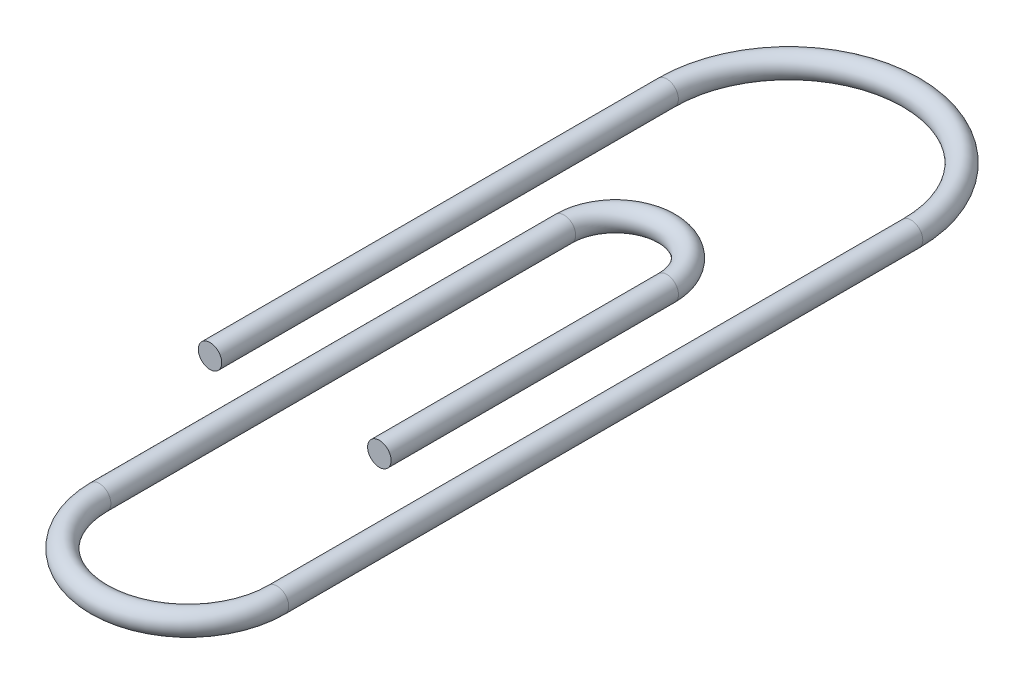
from build123d import *

# Parameters (mm, degrees)
SKETCH1_R = 3.175


with BuildPart() as part:
    # Sweep1: sweep along a path in Sketch2
    with BuildLine(Plane(origin=(0, 0, 0), x_dir=(1, 0, 0), z_dir=(0, 1, 0))) as sweep1_path:
        Line((0, 0), (0, 123.542123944))
        ThreePointArc((0, 123.542123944), (33.058424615, 156.600548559), (66.116849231, 123.542123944))
        Line((66.116849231, 123.542123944), (66.116849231, -47.988922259))
        ThreePointArc((66.116849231, -47.988922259), (42.060473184, -72.045298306), (18.004097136, -47.988922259))
        Line((18.004097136, -47.988922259), (18.004097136, 77.755513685))
        ThreePointArc((18.004097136, 77.755513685), (31.908529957, 91.659946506), (45.812962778, 77.755513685))
        Line((45.812962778, 77.755513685), (45.812962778, 0))
    # Sketch1 → Sweep1 (sweep)
    with BuildSketch(Plane.XY):
        Circle(SKETCH1_R)
    sweep(path=sweep1_path.line)


solid = part.part
